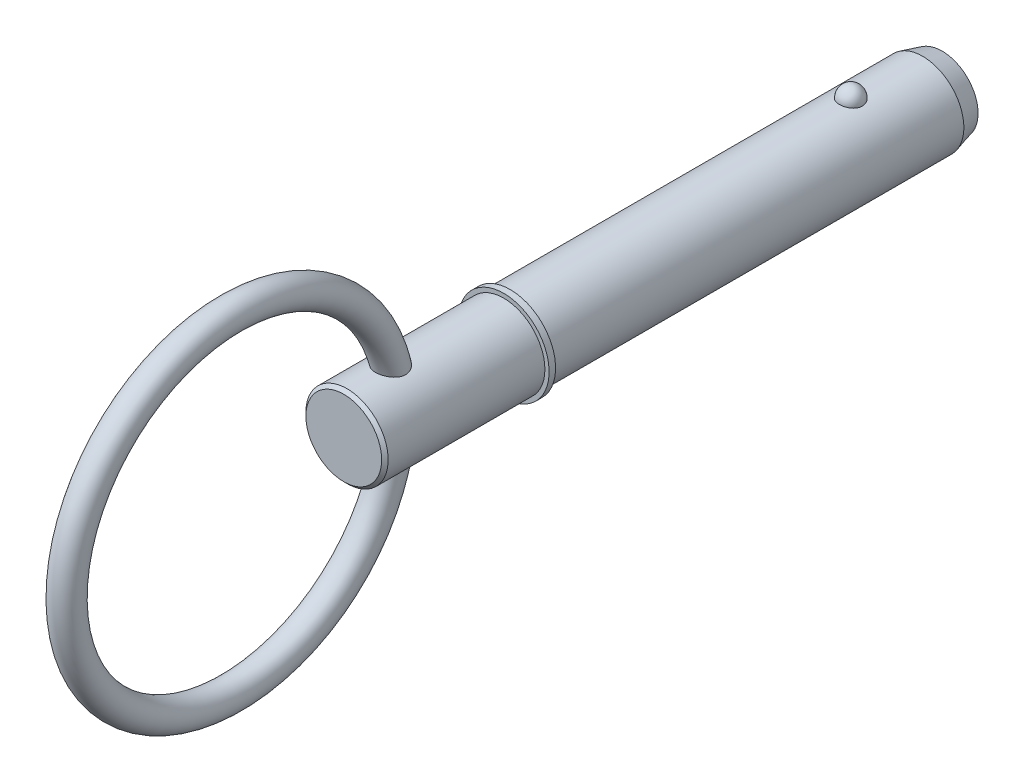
from build123d import *

# Parameters (mm, degrees)
SKETCH2_R           = 6.35
BOSS_EXTRUDE1_DEPTH = 50.8
BOSS_EXTRUDE2_START = 15.88
SKETCH3_R           = 6.35
BOSS_EXTRUDE2_DEPTH = 15.88
CHAMFER1_SIZE       = 3
CHAMFER1_SIZE2      = 0.803847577
SKETCH20_W          = 1
SKETCH20_H          = 7
SKETCH21_R          = 6.35
BOSS_EXTRUDE3_DEPTH = 25.7
CHAMFER2_SIZE       = 0.5
SKETCH24_R          = 2.25


with BuildPart() as part:
    # Sketch2 → Boss-Extrude1 (new body)
    with BuildSketch(Plane.XY):
        Circle(SKETCH2_R)
    extrude(amount=BOSS_EXTRUDE1_DEPTH)

    # Sketch3 → Boss-Extrude2 (add)
    with BuildSketch(Plane(origin=(0, 0, 0), x_dir=(-1, 0, 0), z_dir=(0, 0, -1)).offset(BOSS_EXTRUDE2_START)):
        Circle(SKETCH3_R)
    extrude(amount=-BOSS_EXTRUDE2_DEPTH)

    # Chamfer1
    chamfer1_edges = [part.edges().sort_by_distance(p)[0] for p in [
        (6.35, 0, -15.88),
    ]]
    chamfer1_side = [part.faces().sort_by_distance(p)[0] for p in [
        (6.35, 0, -7.94),
    ]]
    chamfer(chamfer1_edges, length=CHAMFER1_SIZE, length2=CHAMFER1_SIZE2, reference=chamfer1_side[0])

    # Sketch18 → Revolve1 (revolve)
    with BuildSketch(Plane(origin=(0, 0, 0), x_dir=(0, 0, -1), z_dir=(1, 0, 0))):
        with BuildLine():
            Line((1.78, 8.13), (1.78, 4.57))
            ThreePointArc((1.78, 4.57), (0, 6.35), (1.78, 8.13))
        make_face()
    revolve(axis=Axis((0, 8.13, -1.78), (0, -1, 0)))

    # Sketch20 → Revolve2 (revolve)
    with BuildSketch(Plane(origin=(0, 0, 0), x_dir=(0, 0, -1), z_dir=(1, 0, 0)), mode=Mode.PRIVATE) as revolve2_sk:
        with Locations((-51.3, 3.5)):
            Rectangle(SKETCH20_W, SKETCH20_H)
    revolve(revolve2_sk.sketch.rotate(Axis((0, 0, 33.728787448), (0, 0, 1)), 90), axis=Axis((0, 0, 33.728787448), (0, 0, 1)))

    # Sketch21 → Boss-Extrude3 (add)
    with BuildSketch(Plane(origin=(0, 0, 50.8), x_dir=(-1, 0, 0), z_dir=(0, 0, -1))):
        Circle(SKETCH21_R)
    extrude(amount=-BOSS_EXTRUDE3_DEPTH)

    # Chamfer2
    chamfer2_edges = [part.edges().sort_by_distance(p)[0] for p in [
        (6.35, 0, 76.5),
    ]]
    chamfer(chamfer2_edges, length=CHAMFER2_SIZE)

    # Sweep1: sweep along a path in Sketch23
    with BuildLine(Plane(origin=(0, 0, 0), x_dir=(0, 0, -1), z_dir=(1, 0, 0))) as sweep1_path:
        CenterArc((-93.9, 0), 25.4, 0, 360)
    # Sketch24 → Sweep1 (sweep)
    with BuildSketch(Plane(origin=(0, 0, 0), x_dir=(1, 0, 0), z_dir=(0, 1, 0))):
        with Locations((0, -68.5)):
            Circle(SKETCH24_R)
    sweep(path=sweep1_path.line)


solid = part.part
